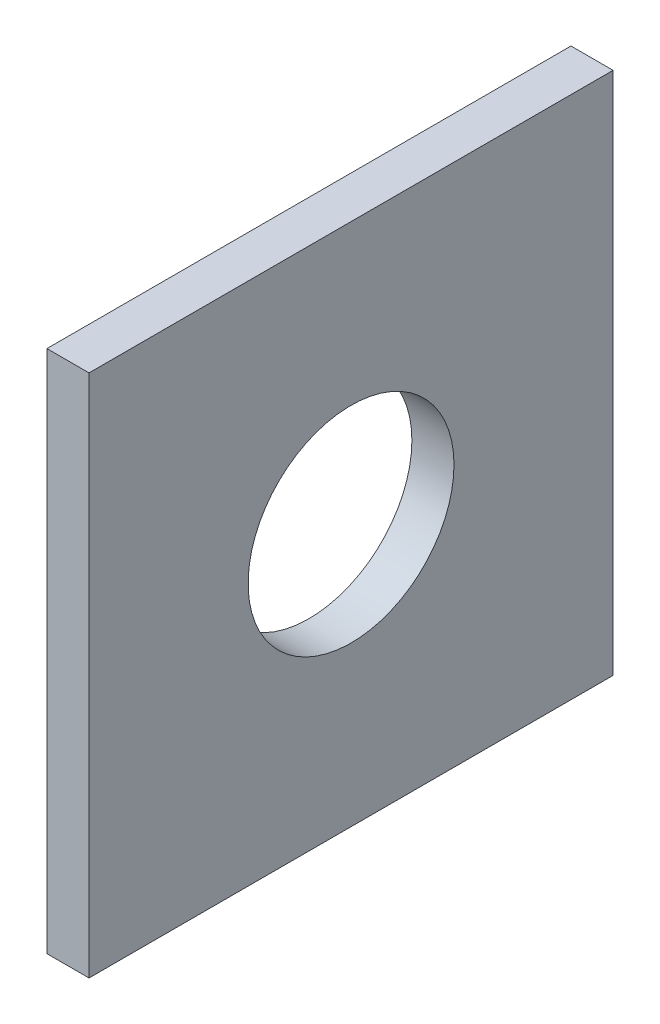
from build123d import *

# Parameters (mm, degrees)
SKETCH1_W  = 56
SKETCH1_H  = 56
SKETCH1_R  = 11
BODY_DEPTH = 4.5


with BuildPart() as part:
    # Sketch1 → Body (new body)
    with BuildSketch(Plane(origin=(0, 0, 0), x_dir=(0, 0, -1), z_dir=(1, 0, 0))):
        Rectangle(SKETCH1_W, SKETCH1_H)
        Circle(SKETCH1_R, mode=Mode.SUBTRACT)
    extrude(amount=-BODY_DEPTH)


solid = part.part
